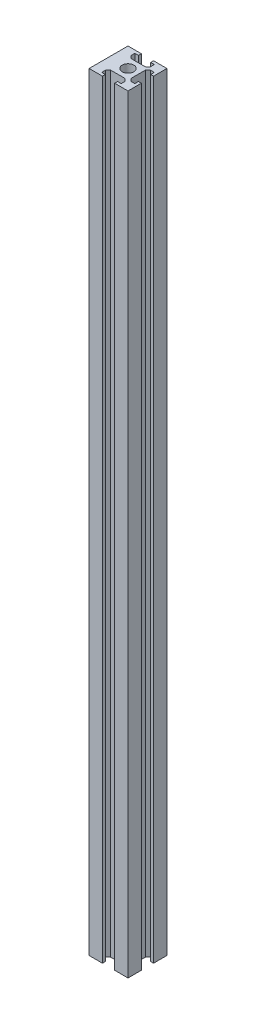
from build123d import *

# Parameters (mm, degrees)
SKIZZE1_R                       = 3
AUFSATZ_LINEAR_AUSTRAGEN1_DEPTH = 395


with BuildPart() as part:
    # Skizze1 → Aufsatz-Linear austragen1 (new body)
    with BuildSketch(Plane(origin=(0, 0, 0), x_dir=(1, 0, 0), z_dir=(0, 1, 0))):
        Polygon((-3.125, 10), (-3.125, 8.5), (-5, 8.5), (-5, 6.504827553), (-3.707168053, 5.2), (3.707168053, 5.2), (5, 6.504827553), (5, 8.5), (3.125, 8.5), (3.125, 10), (10, 10), (10, 3.125), (8.5, 3.125), (8.5, 5), (6.504827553, 5), (5.2, 3.707168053), (5.2, -3.707168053), (6.504827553, -5), (8.5, -5), (8.5, -3.125), (10, -3.125), (10, -10), (3.125, -10), (3.125, -8.5), (5, -8.5), (5, -6.504827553), (3.707168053, -5.2), (-3.707168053, -5.2), (-5, -6.504827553), (-5, -8.5), (-3.125, -8.5), (-3.125, -10), (-10, -10), (-10, 10), align=None)
        with Locations(Location((0, 0, 0), (0, 0, 90))):
            Circle(SKIZZE1_R, mode=Mode.SUBTRACT)
    extrude(amount=AUFSATZ_LINEAR_AUSTRAGEN1_DEPTH)


solid = part.part
